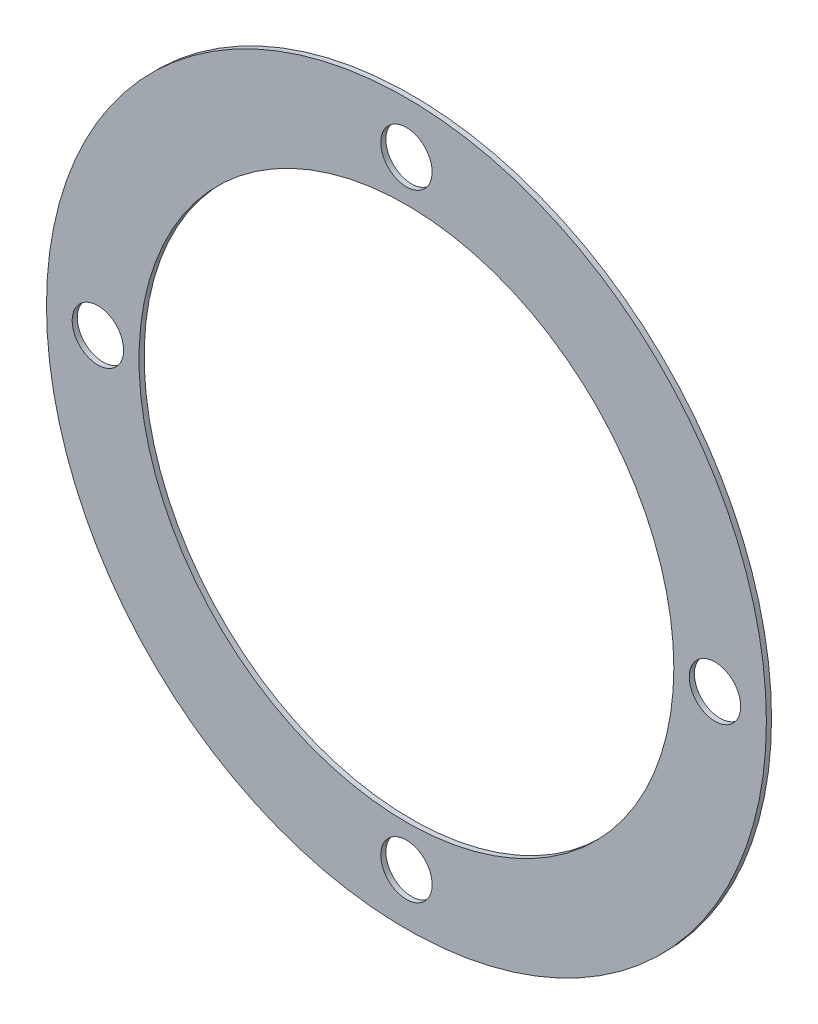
ISO-10303-21;
HEADER;
FILE_DESCRIPTION(('STEP AP214'),'2;1');
FILE_NAME('part.step','',(''),(''),'','','');
FILE_SCHEMA(('AUTOMOTIVE_DESIGN { 1 0 10303 214 1 1 1 1 }'));
ENDSEC;
DATA;
#1=APPLICATION_CONTEXT('core data for automotive mechanical design processes');
#2=APPLICATION_PROTOCOL_DEFINITION('international standard','automotive_design',2000,#1);
#3=PRODUCT_CONTEXT('',#1,'mechanical');
#4=PRODUCT('Part','Part','',(#3));
#5=PRODUCT_RELATED_PRODUCT_CATEGORY('part','',(#4));
#6=PRODUCT_DEFINITION_FORMATION('','',#4);
#7=PRODUCT_DEFINITION_CONTEXT('part definition',#1,'design');
#8=PRODUCT_DEFINITION('design','',#6,#7);
#9=PRODUCT_DEFINITION_SHAPE('','',#8);
#10=(LENGTH_UNIT() NAMED_UNIT(*) SI_UNIT(.MILLI.,.METRE.));
#11=(NAMED_UNIT(*) PLANE_ANGLE_UNIT() SI_UNIT($,.RADIAN.));
#12=(NAMED_UNIT(*) SI_UNIT($,.STERADIAN.) SOLID_ANGLE_UNIT());
#13=UNCERTAINTY_MEASURE_WITH_UNIT(LENGTH_MEASURE(1.E-05),#10,'distance_accuracy_value','');
#14=(GEOMETRIC_REPRESENTATION_CONTEXT(3) GLOBAL_UNCERTAINTY_ASSIGNED_CONTEXT((#13)) GLOBAL_UNIT_ASSIGNED_CONTEXT((#10,
#11,#12)) REPRESENTATION_CONTEXT('',''));
#15=CARTESIAN_POINT('',(0.,0.,0.));
#16=DIRECTION('',(0.,0.,1.));
#17=DIRECTION('',(1.,0.,0.));
#18=AXIS2_PLACEMENT_3D('',#15,#16,#17);
#19=CARTESIAN_POINT('',(0.,0.,0.5));
#20=DIRECTION('',(0.,0.,1.));
#21=DIRECTION('',(1.,0.,0.));
#22=AXIS2_PLACEMENT_3D('',#19,#20,#21);
#23=PLANE('',#22);
#24=CARTESIAN_POINT('',(-30.,3.14233502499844E-13,0.5));
#25=DIRECTION('',(0.,0.,1.));
#26=DIRECTION('',(0.,1.,0.));
#27=AXIS2_PLACEMENT_3D('',#24,#25,#26);
#28=CIRCLE('',#27,2.5);
#29=CARTESIAN_POINT('',(-30.,2.50000000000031,0.5));
#30=VERTEX_POINT('',#29);
#31=EDGE_CURVE('E68',#30,#30,#28,.T.);
#32=ORIENTED_EDGE('',*,*,#31,.F.);
#33=EDGE_LOOP('',(#32));
#34=FACE_BOUND('',#33,.T.);
#35=CARTESIAN_POINT('',(-2.09489001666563E-13,-30.,0.5));
#36=DIRECTION('',(0.,0.,1.));
#37=DIRECTION('',(-1.,0.,0.));
#38=AXIS2_PLACEMENT_3D('',#35,#36,#37);
#39=CIRCLE('',#38,2.5);
#40=CARTESIAN_POINT('',(-2.50000000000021,-30.,0.5));
#41=VERTEX_POINT('',#40);
#42=EDGE_CURVE('E62',#41,#41,#39,.T.);
#43=ORIENTED_EDGE('',*,*,#42,.F.);
#44=EDGE_LOOP('',(#43));
#45=FACE_BOUND('',#44,.T.);
#46=CARTESIAN_POINT('',(30.,-1.04744500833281E-13,0.5));
#47=DIRECTION('',(0.,0.,1.));
#48=DIRECTION('',(0.,-1.,0.));
#49=AXIS2_PLACEMENT_3D('',#46,#47,#48);
#50=CIRCLE('',#49,2.5);
#51=CARTESIAN_POINT('',(30.,-2.5000000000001,0.5));
#52=VERTEX_POINT('',#51);
#53=EDGE_CURVE('E56',#52,#52,#50,.T.);
#54=ORIENTED_EDGE('',*,*,#53,.F.);
#55=EDGE_LOOP('',(#54));
#56=FACE_BOUND('',#55,.T.);
#57=CARTESIAN_POINT('',(0.,30.,0.5));
#58=DIRECTION('',(0.,0.,1.));
#59=DIRECTION('',(1.,0.,0.));
#60=AXIS2_PLACEMENT_3D('',#57,#58,#59);
#61=CIRCLE('',#60,2.5);
#62=CARTESIAN_POINT('',(2.5,30.,0.5));
#63=VERTEX_POINT('',#62);
#64=EDGE_CURVE('E50',#63,#63,#61,.T.);
#65=ORIENTED_EDGE('',*,*,#64,.F.);
#66=EDGE_LOOP('',(#65));
#67=FACE_BOUND('',#66,.T.);
#68=CARTESIAN_POINT('',(0.,0.,0.5));
#69=DIRECTION('',(0.,0.,1.));
#70=DIRECTION('',(1.,0.,0.));
#71=AXIS2_PLACEMENT_3D('',#68,#69,#70);
#72=CIRCLE('',#71,35.);
#73=CARTESIAN_POINT('',(35.,0.,0.5));
#74=VERTEX_POINT('',#73);
#75=EDGE_CURVE('E10',#74,#74,#72,.T.);
#76=ORIENTED_EDGE('',*,*,#75,.T.);
#77=EDGE_LOOP('',(#76));
#78=FACE_BOUND('',#77,.T.);
#79=CARTESIAN_POINT('',(0.,0.,0.5));
#80=DIRECTION('',(0.,0.,1.));
#81=DIRECTION('',(1.,0.,0.));
#82=AXIS2_PLACEMENT_3D('',#79,#80,#81);
#83=CIRCLE('',#82,26.);
#84=CARTESIAN_POINT('',(26.,0.,0.5));
#85=VERTEX_POINT('',#84);
#86=EDGE_CURVE('E38',#85,#85,#83,.T.);
#87=ORIENTED_EDGE('',*,*,#86,.F.);
#88=EDGE_LOOP('',(#87));
#89=FACE_BOUND('',#88,.T.);
#90=ADVANCED_FACE('F27',(#34,#45,#56,#67,#78,#89),#23,.T.);
#91=CARTESIAN_POINT('',(0.,0.,0.));
#92=DIRECTION('',(0.,0.,1.));
#93=DIRECTION('',(1.,0.,0.));
#94=AXIS2_PLACEMENT_3D('',#91,#92,#93);
#95=PLANE('',#94);
#96=CARTESIAN_POINT('',(-30.,3.14233502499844E-13,0.));
#97=DIRECTION('',(0.,0.,1.));
#98=DIRECTION('',(0.,1.,0.));
#99=AXIS2_PLACEMENT_3D('',#96,#97,#98);
#100=CIRCLE('',#99,2.5);
#101=CARTESIAN_POINT('',(-30.,2.50000000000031,0.));
#102=VERTEX_POINT('',#101);
#103=EDGE_CURVE('E65',#102,#102,#100,.T.);
#104=ORIENTED_EDGE('',*,*,#103,.T.);
#105=EDGE_LOOP('',(#104));
#106=FACE_BOUND('',#105,.T.);
#107=CARTESIAN_POINT('',(-2.09489001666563E-13,-30.,0.));
#108=DIRECTION('',(0.,0.,1.));
#109=DIRECTION('',(-1.,0.,0.));
#110=AXIS2_PLACEMENT_3D('',#107,#108,#109);
#111=CIRCLE('',#110,2.5);
#112=CARTESIAN_POINT('',(-2.50000000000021,-30.,0.));
#113=VERTEX_POINT('',#112);
#114=EDGE_CURVE('E59',#113,#113,#111,.T.);
#115=ORIENTED_EDGE('',*,*,#114,.T.);
#116=EDGE_LOOP('',(#115));
#117=FACE_BOUND('',#116,.T.);
#118=CARTESIAN_POINT('',(30.,-1.04744500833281E-13,0.));
#119=DIRECTION('',(0.,0.,1.));
#120=DIRECTION('',(0.,-1.,0.));
#121=AXIS2_PLACEMENT_3D('',#118,#119,#120);
#122=CIRCLE('',#121,2.5);
#123=CARTESIAN_POINT('',(30.,-2.5000000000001,0.));
#124=VERTEX_POINT('',#123);
#125=EDGE_CURVE('E53',#124,#124,#122,.T.);
#126=ORIENTED_EDGE('',*,*,#125,.T.);
#127=EDGE_LOOP('',(#126));
#128=FACE_BOUND('',#127,.T.);
#129=CARTESIAN_POINT('',(0.,30.,0.));
#130=DIRECTION('',(0.,0.,1.));
#131=DIRECTION('',(1.,0.,0.));
#132=AXIS2_PLACEMENT_3D('',#129,#130,#131);
#133=CIRCLE('',#132,2.5);
#134=CARTESIAN_POINT('',(2.5,30.,0.));
#135=VERTEX_POINT('',#134);
#136=EDGE_CURVE('E47',#135,#135,#133,.T.);
#137=ORIENTED_EDGE('',*,*,#136,.T.);
#138=EDGE_LOOP('',(#137));
#139=FACE_BOUND('',#138,.T.);
#140=CARTESIAN_POINT('',(0.,0.,0.));
#141=DIRECTION('',(0.,0.,1.));
#142=DIRECTION('',(1.,0.,0.));
#143=AXIS2_PLACEMENT_3D('',#140,#141,#142);
#144=CIRCLE('',#143,35.);
#145=CARTESIAN_POINT('',(35.,0.,0.));
#146=VERTEX_POINT('',#145);
#147=EDGE_CURVE('E34',#146,#146,#144,.T.);
#148=ORIENTED_EDGE('',*,*,#147,.F.);
#149=EDGE_LOOP('',(#148));
#150=FACE_BOUND('',#149,.T.);
#151=CARTESIAN_POINT('',(0.,0.,0.));
#152=DIRECTION('',(0.,0.,1.));
#153=DIRECTION('',(1.,0.,0.));
#154=AXIS2_PLACEMENT_3D('',#151,#152,#153);
#155=CIRCLE('',#154,26.);
#156=CARTESIAN_POINT('',(26.,0.,0.));
#157=VERTEX_POINT('',#156);
#158=EDGE_CURVE('E42',#157,#157,#155,.T.);
#159=ORIENTED_EDGE('',*,*,#158,.T.);
#160=EDGE_LOOP('',(#159));
#161=FACE_BOUND('',#160,.T.);
#162=ADVANCED_FACE('F76',(#106,#117,#128,#139,#150,#161),#95,.F.);
#163=CARTESIAN_POINT('',(0.,0.,0.5));
#164=DIRECTION('',(0.,0.,-1.));
#165=DIRECTION('',(-1.,0.,0.));
#166=AXIS2_PLACEMENT_3D('',#163,#164,#165);
#167=CYLINDRICAL_SURFACE('',#166,35.);
#168=ORIENTED_EDGE('',*,*,#75,.F.);
#169=EDGE_LOOP('',(#168));
#170=FACE_BOUND('',#169,.T.);
#171=ORIENTED_EDGE('',*,*,#147,.T.);
#172=EDGE_LOOP('',(#171));
#173=FACE_BOUND('',#172,.T.);
#174=ADVANCED_FACE('F29',(#170,#173),#167,.T.);
#175=CARTESIAN_POINT('',(0.,0.,0.5));
#176=DIRECTION('',(0.,0.,-1.));
#177=DIRECTION('',(-1.,0.,0.));
#178=AXIS2_PLACEMENT_3D('',#175,#176,#177);
#179=CYLINDRICAL_SURFACE('',#178,26.);
#180=ORIENTED_EDGE('',*,*,#86,.T.);
#181=EDGE_LOOP('',(#180));
#182=FACE_BOUND('',#181,.T.);
#183=ORIENTED_EDGE('',*,*,#158,.F.);
#184=EDGE_LOOP('',(#183));
#185=FACE_BOUND('',#184,.T.);
#186=ADVANCED_FACE('F85',(#182,#185),#179,.F.);
#187=CARTESIAN_POINT('',(0.,30.,0.));
#188=DIRECTION('',(0.,0.,1.));
#189=DIRECTION('',(1.,0.,0.));
#190=AXIS2_PLACEMENT_3D('',#187,#188,#189);
#191=CYLINDRICAL_SURFACE('',#190,2.5);
#192=ORIENTED_EDGE('',*,*,#136,.F.);
#193=EDGE_LOOP('',(#192));
#194=FACE_BOUND('',#193,.T.);
#195=ORIENTED_EDGE('',*,*,#64,.T.);
#196=EDGE_LOOP('',(#195));
#197=FACE_BOUND('',#196,.T.);
#198=ADVANCED_FACE('F88',(#194,#197),#191,.F.);
#199=CARTESIAN_POINT('',(30.,-1.04744500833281E-13,0.));
#200=DIRECTION('',(0.,0.,1.));
#201=DIRECTION('',(1.,0.,0.));
#202=AXIS2_PLACEMENT_3D('',#199,#200,#201);
#203=CYLINDRICAL_SURFACE('',#202,2.5);
#204=ORIENTED_EDGE('',*,*,#125,.F.);
#205=EDGE_LOOP('',(#204));
#206=FACE_BOUND('',#205,.T.);
#207=ORIENTED_EDGE('',*,*,#53,.T.);
#208=EDGE_LOOP('',(#207));
#209=FACE_BOUND('',#208,.T.);
#210=ADVANCED_FACE('F103',(#206,#209),#203,.F.);
#211=CARTESIAN_POINT('',(-2.09489001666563E-13,-30.,0.));
#212=DIRECTION('',(0.,0.,1.));
#213=DIRECTION('',(1.,0.,0.));
#214=AXIS2_PLACEMENT_3D('',#211,#212,#213);
#215=CYLINDRICAL_SURFACE('',#214,2.5);
#216=ORIENTED_EDGE('',*,*,#114,.F.);
#217=EDGE_LOOP('',(#216));
#218=FACE_BOUND('',#217,.T.);
#219=ORIENTED_EDGE('',*,*,#42,.T.);
#220=EDGE_LOOP('',(#219));
#221=FACE_BOUND('',#220,.T.);
#222=ADVANCED_FACE('F107',(#218,#221),#215,.F.);
#223=CARTESIAN_POINT('',(-30.,3.14233502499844E-13,0.));
#224=DIRECTION('',(0.,0.,1.));
#225=DIRECTION('',(1.,0.,0.));
#226=AXIS2_PLACEMENT_3D('',#223,#224,#225);
#227=CYLINDRICAL_SURFACE('',#226,2.5);
#228=ORIENTED_EDGE('',*,*,#103,.F.);
#229=EDGE_LOOP('',(#228));
#230=FACE_BOUND('',#229,.T.);
#231=ORIENTED_EDGE('',*,*,#31,.T.);
#232=EDGE_LOOP('',(#231));
#233=FACE_BOUND('',#232,.T.);
#234=ADVANCED_FACE('F72',(#230,#233),#227,.F.);
#235=CLOSED_SHELL('',(#90,#162,#174,#186,#198,#210,#222,#234));
#236=MANIFOLD_SOLID_BREP('B2',#235);
#237=ADVANCED_BREP_SHAPE_REPRESENTATION('',(#18,#236),#14);
#238=SHAPE_DEFINITION_REPRESENTATION(#9,#237);
ENDSEC;
END-ISO-10303-21;
